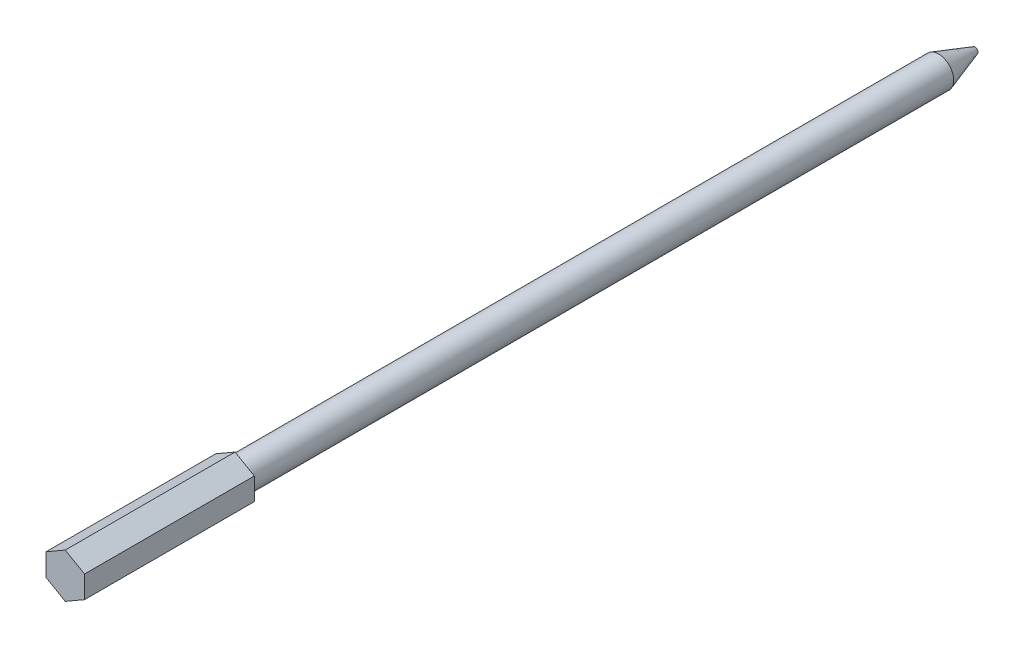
ISO-10303-21;
HEADER;
FILE_DESCRIPTION(('STEP AP214'),'2;1');
FILE_NAME('part.step','',(''),(''),'','','');
FILE_SCHEMA(('AUTOMOTIVE_DESIGN { 1 0 10303 214 1 1 1 1 }'));
ENDSEC;
DATA;
#1=APPLICATION_CONTEXT('core data for automotive mechanical design processes');
#2=APPLICATION_PROTOCOL_DEFINITION('international standard','automotive_design',2000,#1);
#3=PRODUCT_CONTEXT('',#1,'mechanical');
#4=PRODUCT('Part','Part','',(#3));
#5=PRODUCT_RELATED_PRODUCT_CATEGORY('part','',(#4));
#6=PRODUCT_DEFINITION_FORMATION('','',#4);
#7=PRODUCT_DEFINITION_CONTEXT('part definition',#1,'design');
#8=PRODUCT_DEFINITION('design','',#6,#7);
#9=PRODUCT_DEFINITION_SHAPE('','',#8);
#10=(LENGTH_UNIT() NAMED_UNIT(*) SI_UNIT(.MILLI.,.METRE.));
#11=(NAMED_UNIT(*) PLANE_ANGLE_UNIT() SI_UNIT($,.RADIAN.));
#12=(NAMED_UNIT(*) SI_UNIT($,.STERADIAN.) SOLID_ANGLE_UNIT());
#13=UNCERTAINTY_MEASURE_WITH_UNIT(LENGTH_MEASURE(1.E-05),#10,'distance_accuracy_value','');
#14=(GEOMETRIC_REPRESENTATION_CONTEXT(3) GLOBAL_UNCERTAINTY_ASSIGNED_CONTEXT((#13)) GLOBAL_UNIT_ASSIGNED_CONTEXT((#10,
#11,#12)) REPRESENTATION_CONTEXT('',''));
#15=CARTESIAN_POINT('',(0.,0.,0.));
#16=DIRECTION('',(0.,0.,1.));
#17=DIRECTION('',(1.,0.,0.));
#18=AXIS2_PLACEMENT_3D('',#15,#16,#17);
#19=CARTESIAN_POINT('',(0.,0.,122.));
#20=DIRECTION('',(0.,0.,-1.));
#21=DIRECTION('',(-1.,0.,0.));
#22=AXIS2_PLACEMENT_3D('',#19,#20,#21);
#23=CYLINDRICAL_SURFACE('',#22,2.5);
#24=CARTESIAN_POINT('',(0.,0.,6.0000000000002));
#25=DIRECTION('',(0.,0.,1.));
#26=DIRECTION('',(1.,0.,0.));
#27=AXIS2_PLACEMENT_3D('',#24,#25,#26);
#28=CIRCLE('',#27,2.5);
#29=CARTESIAN_POINT('',(2.5,0.,6.0000000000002));
#30=VERTEX_POINT('',#29);
#31=EDGE_CURVE('E25',#30,#30,#28,.T.);
#32=ORIENTED_EDGE('',*,*,#31,.T.);
#33=EDGE_LOOP('',(#32));
#34=FACE_BOUND('',#33,.T.);
#35=CARTESIAN_POINT('',(0.,0.,122.));
#36=DIRECTION('',(0.,0.,1.));
#37=DIRECTION('',(1.,0.,0.));
#38=AXIS2_PLACEMENT_3D('',#35,#36,#37);
#39=CIRCLE('',#38,2.5);
#40=CARTESIAN_POINT('',(2.5,0.,122.));
#41=VERTEX_POINT('',#40);
#42=EDGE_CURVE('E121',#41,#41,#39,.T.);
#43=ORIENTED_EDGE('',*,*,#42,.F.);
#44=EDGE_LOOP('',(#43));
#45=FACE_BOUND('',#44,.T.);
#46=ADVANCED_FACE('F16',(#34,#45),#23,.T.);
#47=CARTESIAN_POINT('',(0.,0.,0.));
#48=DIRECTION('',(0.,0.,1.));
#49=DIRECTION('',(1.,0.,0.));
#50=AXIS2_PLACEMENT_3D('',#47,#48,#49);
#51=PLANE('',#50);
#52=CARTESIAN_POINT('',(0.,0.,0.));
#53=DIRECTION('',(0.,0.,1.));
#54=DIRECTION('',(1.,0.,0.));
#55=AXIS2_PLACEMENT_3D('',#52,#53,#54);
#56=CIRCLE('',#55,0.499999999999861);
#57=CARTESIAN_POINT('',(0.499999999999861,0.,0.));
#58=VERTEX_POINT('',#57);
#59=EDGE_CURVE('E11',#58,#58,#56,.F.);
#60=ORIENTED_EDGE('',*,*,#59,.T.);
#61=EDGE_LOOP('',(#60));
#62=FACE_BOUND('',#61,.T.);
#63=ADVANCED_FACE('F140',(#62),#51,.F.);
#64=CARTESIAN_POINT('',(-3.175,-1.83308710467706,150.));
#65=DIRECTION('',(0.5,0.866025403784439,0.));
#66=DIRECTION('',(-0.866025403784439,0.5,0.));
#67=AXIS2_PLACEMENT_3D('',#64,#65,#66);
#68=PLANE('',#67);
#69=DIRECTION('',(0.866025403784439,-0.5,0.));
#70=VECTOR('',#69,1.);
#71=CARTESIAN_POINT('',(-3.175,-1.83308710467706,122.));
#72=LINE('',#71,#70);
#73=CARTESIAN_POINT('',(-3.175,-1.83308710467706,122.));
#74=VERTEX_POINT('',#73);
#75=CARTESIAN_POINT('',(0.,-3.66617420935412,122.));
#76=VERTEX_POINT('',#75);
#77=EDGE_CURVE('E102',#74,#76,#72,.T.);
#78=ORIENTED_EDGE('',*,*,#77,.T.);
#79=DIRECTION('',(0.,0.,-1.));
#80=VECTOR('',#79,1.);
#81=CARTESIAN_POINT('',(0.,-3.66617420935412,150.));
#82=LINE('',#81,#80);
#83=CARTESIAN_POINT('',(0.,-3.66617420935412,150.));
#84=VERTEX_POINT('',#83);
#85=EDGE_CURVE('E119',#84,#76,#82,.T.);
#86=ORIENTED_EDGE('',*,*,#85,.F.);
#87=DIRECTION('',(0.866025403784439,-0.5,0.));
#88=VECTOR('',#87,1.);
#89=CARTESIAN_POINT('',(-3.175,-1.83308710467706,150.));
#90=LINE('',#89,#88);
#91=CARTESIAN_POINT('',(-3.175,-1.83308710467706,150.));
#92=VERTEX_POINT('',#91);
#93=EDGE_CURVE('E112',#92,#84,#90,.T.);
#94=ORIENTED_EDGE('',*,*,#93,.F.);
#95=DIRECTION('',(0.,0.,-1.));
#96=VECTOR('',#95,1.);
#97=CARTESIAN_POINT('',(-3.175,-1.83308710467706,150.));
#98=LINE('',#97,#96);
#99=EDGE_CURVE('E98',#92,#74,#98,.T.);
#100=ORIENTED_EDGE('',*,*,#99,.T.);
#101=EDGE_LOOP('',(#78,#86,#94,#100));
#102=FACE_BOUND('',#101,.T.);
#103=ADVANCED_FACE('F145',(#102),#68,.F.);
#104=CARTESIAN_POINT('',(0.,-3.66617420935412,150.));
#105=DIRECTION('',(-0.5,0.866025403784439,0.));
#106=DIRECTION('',(-0.866025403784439,-0.5,0.));
#107=AXIS2_PLACEMENT_3D('',#104,#105,#106);
#108=PLANE('',#107);
#109=DIRECTION('',(0.866025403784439,0.5,0.));
#110=VECTOR('',#109,1.);
#111=CARTESIAN_POINT('',(0.,-3.66617420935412,122.));
#112=LINE('',#111,#110);
#113=CARTESIAN_POINT('',(3.175,-1.83308710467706,122.));
#114=VERTEX_POINT('',#113);
#115=EDGE_CURVE('E105',#76,#114,#112,.T.);
#116=ORIENTED_EDGE('',*,*,#115,.T.);
#117=DIRECTION('',(0.,0.,-1.));
#118=VECTOR('',#117,1.);
#119=CARTESIAN_POINT('',(3.175,-1.83308710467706,150.));
#120=LINE('',#119,#118);
#121=CARTESIAN_POINT('',(3.175,-1.83308710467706,150.));
#122=VERTEX_POINT('',#121);
#123=EDGE_CURVE('E116',#122,#114,#120,.T.);
#124=ORIENTED_EDGE('',*,*,#123,.F.);
#125=DIRECTION('',(0.866025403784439,0.5,0.));
#126=VECTOR('',#125,1.);
#127=CARTESIAN_POINT('',(0.,-3.66617420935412,150.));
#128=LINE('',#127,#126);
#129=EDGE_CURVE('E71',#84,#122,#128,.T.);
#130=ORIENTED_EDGE('',*,*,#129,.F.);
#131=ORIENTED_EDGE('',*,*,#85,.T.);
#132=EDGE_LOOP('',(#116,#124,#130,#131));
#133=FACE_BOUND('',#132,.T.);
#134=ADVANCED_FACE('F151',(#133),#108,.F.);
#135=CARTESIAN_POINT('',(3.175,-1.83308710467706,150.));
#136=DIRECTION('',(-1.,0.,0.));
#137=DIRECTION('',(0.,-1.,0.));
#138=AXIS2_PLACEMENT_3D('',#135,#136,#137);
#139=PLANE('',#138);
#140=DIRECTION('',(0.,1.,0.));
#141=VECTOR('',#140,1.);
#142=CARTESIAN_POINT('',(3.175,-1.83308710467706,122.));
#143=LINE('',#142,#141);
#144=CARTESIAN_POINT('',(3.175,1.83308710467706,122.));
#145=VERTEX_POINT('',#144);
#146=EDGE_CURVE('E107',#114,#145,#143,.T.);
#147=ORIENTED_EDGE('',*,*,#146,.T.);
#148=DIRECTION('',(0.,0.,-1.));
#149=VECTOR('',#148,1.);
#150=CARTESIAN_POINT('',(3.175,1.83308710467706,150.));
#151=LINE('',#150,#149);
#152=CARTESIAN_POINT('',(3.175,1.83308710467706,150.));
#153=VERTEX_POINT('',#152);
#154=EDGE_CURVE('E93',#153,#145,#151,.T.);
#155=ORIENTED_EDGE('',*,*,#154,.F.);
#156=DIRECTION('',(0.,1.,0.));
#157=VECTOR('',#156,1.);
#158=CARTESIAN_POINT('',(3.175,-1.83308710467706,150.));
#159=LINE('',#158,#157);
#160=EDGE_CURVE('E84',#122,#153,#159,.T.);
#161=ORIENTED_EDGE('',*,*,#160,.F.);
#162=ORIENTED_EDGE('',*,*,#123,.T.);
#163=EDGE_LOOP('',(#147,#155,#161,#162));
#164=FACE_BOUND('',#163,.T.);
#165=ADVANCED_FACE('F155',(#164),#139,.F.);
#166=CARTESIAN_POINT('',(3.175,1.83308710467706,150.));
#167=DIRECTION('',(-0.5,-0.866025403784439,0.));
#168=DIRECTION('',(0.866025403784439,-0.5,0.));
#169=AXIS2_PLACEMENT_3D('',#166,#167,#168);
#170=PLANE('',#169);
#171=DIRECTION('',(-0.866025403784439,0.5,0.));
#172=VECTOR('',#171,1.);
#173=CARTESIAN_POINT('',(3.175,1.83308710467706,122.));
#174=LINE('',#173,#172);
#175=CARTESIAN_POINT('',(0.,3.66617420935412,122.));
#176=VERTEX_POINT('',#175);
#177=EDGE_CURVE('E92',#145,#176,#174,.T.);
#178=ORIENTED_EDGE('',*,*,#177,.T.);
#179=DIRECTION('',(0.,0.,-1.));
#180=VECTOR('',#179,1.);
#181=CARTESIAN_POINT('',(0.,3.66617420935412,150.));
#182=LINE('',#181,#180);
#183=CARTESIAN_POINT('',(0.,3.66617420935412,150.));
#184=VERTEX_POINT('',#183);
#185=EDGE_CURVE('E89',#184,#176,#182,.T.);
#186=ORIENTED_EDGE('',*,*,#185,.F.);
#187=DIRECTION('',(-0.866025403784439,0.5,0.));
#188=VECTOR('',#187,1.);
#189=CARTESIAN_POINT('',(3.175,1.83308710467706,150.));
#190=LINE('',#189,#188);
#191=EDGE_CURVE('E78',#153,#184,#190,.T.);
#192=ORIENTED_EDGE('',*,*,#191,.F.);
#193=ORIENTED_EDGE('',*,*,#154,.T.);
#194=EDGE_LOOP('',(#178,#186,#192,#193));
#195=FACE_BOUND('',#194,.T.);
#196=ADVANCED_FACE('F90',(#195),#170,.F.);
#197=CARTESIAN_POINT('',(0.,3.66617420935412,150.));
#198=DIRECTION('',(0.5,-0.866025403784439,0.));
#199=DIRECTION('',(0.866025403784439,0.5,0.));
#200=AXIS2_PLACEMENT_3D('',#197,#198,#199);
#201=PLANE('',#200);
#202=DIRECTION('',(-0.866025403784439,-0.5,0.));
#203=VECTOR('',#202,1.);
#204=CARTESIAN_POINT('',(0.,3.66617420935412,122.));
#205=LINE('',#204,#203);
#206=CARTESIAN_POINT('',(-3.175,1.83308710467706,122.));
#207=VERTEX_POINT('',#206);
#208=EDGE_CURVE('E56',#176,#207,#205,.T.);
#209=ORIENTED_EDGE('',*,*,#208,.T.);
#210=DIRECTION('',(0.,0.,-1.));
#211=VECTOR('',#210,1.);
#212=CARTESIAN_POINT('',(-3.175,1.83308710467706,150.));
#213=LINE('',#212,#211);
#214=CARTESIAN_POINT('',(-3.175,1.83308710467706,150.));
#215=VERTEX_POINT('',#214);
#216=EDGE_CURVE('E94',#215,#207,#213,.T.);
#217=ORIENTED_EDGE('',*,*,#216,.F.);
#218=DIRECTION('',(-0.866025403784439,-0.5,0.));
#219=VECTOR('',#218,1.);
#220=CARTESIAN_POINT('',(0.,3.66617420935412,150.));
#221=LINE('',#220,#219);
#222=EDGE_CURVE('E82',#184,#215,#221,.T.);
#223=ORIENTED_EDGE('',*,*,#222,.F.);
#224=ORIENTED_EDGE('',*,*,#185,.T.);
#225=EDGE_LOOP('',(#209,#217,#223,#224));
#226=FACE_BOUND('',#225,.T.);
#227=ADVANCED_FACE('F96',(#226),#201,.F.);
#228=CARTESIAN_POINT('',(-3.175,1.83308710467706,150.));
#229=DIRECTION('',(1.,0.,0.));
#230=DIRECTION('',(0.,0.,-1.));
#231=AXIS2_PLACEMENT_3D('',#228,#229,#230);
#232=PLANE('',#231);
#233=DIRECTION('',(0.,-1.,0.));
#234=VECTOR('',#233,1.);
#235=CARTESIAN_POINT('',(-3.175,1.83308710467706,122.));
#236=LINE('',#235,#234);
#237=EDGE_CURVE('E62',#207,#74,#236,.T.);
#238=ORIENTED_EDGE('',*,*,#237,.T.);
#239=ORIENTED_EDGE('',*,*,#99,.F.);
#240=DIRECTION('',(0.,-1.,0.));
#241=VECTOR('',#240,1.);
#242=CARTESIAN_POINT('',(-3.175,1.83308710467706,150.));
#243=LINE('',#242,#241);
#244=EDGE_CURVE('E33',#215,#92,#243,.T.);
#245=ORIENTED_EDGE('',*,*,#244,.F.);
#246=ORIENTED_EDGE('',*,*,#216,.T.);
#247=EDGE_LOOP('',(#238,#239,#245,#246));
#248=FACE_BOUND('',#247,.T.);
#249=ADVANCED_FACE('F163',(#248),#232,.F.);
#250=CARTESIAN_POINT('',(0.,0.,150.));
#251=DIRECTION('',(0.,0.,1.));
#252=DIRECTION('',(1.,0.,0.));
#253=AXIS2_PLACEMENT_3D('',#250,#251,#252);
#254=PLANE('',#253);
#255=ORIENTED_EDGE('',*,*,#93,.T.);
#256=ORIENTED_EDGE('',*,*,#129,.T.);
#257=ORIENTED_EDGE('',*,*,#160,.T.);
#258=ORIENTED_EDGE('',*,*,#191,.T.);
#259=ORIENTED_EDGE('',*,*,#222,.T.);
#260=ORIENTED_EDGE('',*,*,#244,.T.);
#261=EDGE_LOOP('',(#255,#256,#257,#258,#259,#260));
#262=FACE_BOUND('',#261,.T.);
#263=ADVANCED_FACE('F80',(#262),#254,.T.);
#264=CARTESIAN_POINT('',(0.,0.,122.));
#265=DIRECTION('',(0.,0.,1.));
#266=DIRECTION('',(1.,0.,0.));
#267=AXIS2_PLACEMENT_3D('',#264,#265,#266);
#268=PLANE('',#267);
#269=ORIENTED_EDGE('',*,*,#42,.T.);
#270=EDGE_LOOP('',(#269));
#271=FACE_BOUND('',#270,.T.);
#272=ORIENTED_EDGE('',*,*,#77,.F.);
#273=ORIENTED_EDGE('',*,*,#237,.F.);
#274=ORIENTED_EDGE('',*,*,#208,.F.);
#275=ORIENTED_EDGE('',*,*,#177,.F.);
#276=ORIENTED_EDGE('',*,*,#146,.F.);
#277=ORIENTED_EDGE('',*,*,#115,.F.);
#278=EDGE_LOOP('',(#272,#273,#274,#275,#276,#277));
#279=FACE_BOUND('',#278,.T.);
#280=ADVANCED_FACE('F129',(#271,#279),#268,.F.);
#281=CARTESIAN_POINT('',(0.,0.,6.0000000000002));
#282=DIRECTION('',(0.,0.,1.));
#283=DIRECTION('',(1.,0.,0.));
#284=AXIS2_PLACEMENT_3D('',#281,#282,#283);
#285=CONICAL_SURFACE('',#284,2.5,0.321750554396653);
#286=CARTESIAN_POINT('',(0.499999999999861,0.,0.));
#287=CARTESIAN_POINT('',(0.520833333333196,0.,0.0625000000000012));
#288=CARTESIAN_POINT('',(0.541666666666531,0.,0.125000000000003));
#289=CARTESIAN_POINT('',(0.5833333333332,0.,0.250000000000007));
#290=CARTESIAN_POINT('',(0.604166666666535,0.,0.312500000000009));
#291=CARTESIAN_POINT('',(0.645833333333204,0.,0.437500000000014));
#292=CARTESIAN_POINT('',(0.666666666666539,0.,0.500000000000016));
#293=CARTESIAN_POINT('',(0.708333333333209,0.,0.62500000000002));
#294=CARTESIAN_POINT('',(0.729166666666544,0.,0.687500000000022));
#295=CARTESIAN_POINT('',(0.770833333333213,0.,0.812500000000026));
#296=CARTESIAN_POINT('',(0.791666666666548,0.,0.875000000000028));
#297=CARTESIAN_POINT('',(0.833333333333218,0.,1.00000000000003));
#298=CARTESIAN_POINT('',(0.854166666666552,0.,1.06250000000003));
#299=CARTESIAN_POINT('',(0.895833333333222,0.,1.18750000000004));
#300=CARTESIAN_POINT('',(0.916666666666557,0.,1.25000000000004));
#301=CARTESIAN_POINT('',(0.958333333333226,0.,1.37500000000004));
#302=CARTESIAN_POINT('',(0.979166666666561,0.,1.43750000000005));
#303=CARTESIAN_POINT('',(1.02083333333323,0.,1.56250000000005));
#304=CARTESIAN_POINT('',(1.04166666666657,0.,1.62500000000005));
#305=CARTESIAN_POINT('',(1.08333333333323,0.,1.75000000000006));
#306=CARTESIAN_POINT('',(1.10416666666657,0.,1.81250000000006));
#307=CARTESIAN_POINT('',(1.14583333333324,0.,1.93750000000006));
#308=CARTESIAN_POINT('',(1.16666666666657,0.,2.00000000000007));
#309=CARTESIAN_POINT('',(1.20833333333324,0.,2.12500000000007));
#310=CARTESIAN_POINT('',(1.22916666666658,0.,2.18750000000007));
#311=CARTESIAN_POINT('',(1.27083333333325,0.,2.31250000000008));
#312=CARTESIAN_POINT('',(1.29166666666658,0.,2.37500000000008));
#313=CARTESIAN_POINT('',(1.33333333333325,0.,2.50000000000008));
#314=CARTESIAN_POINT('',(1.35416666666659,0.,2.56250000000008));
#315=CARTESIAN_POINT('',(1.39583333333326,0.,2.68750000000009));
#316=CARTESIAN_POINT('',(1.41666666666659,0.,2.75000000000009));
#317=CARTESIAN_POINT('',(1.45833333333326,0.,2.8750000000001));
#318=CARTESIAN_POINT('',(1.4791666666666,0.,2.9375000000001));
#319=CARTESIAN_POINT('',(1.52083333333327,0.,3.0625000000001));
#320=CARTESIAN_POINT('',(1.5416666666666,0.,3.1250000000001));
#321=CARTESIAN_POINT('',(1.58333333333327,0.,3.25000000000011));
#322=CARTESIAN_POINT('',(1.6041666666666,0.,3.31250000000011));
#323=CARTESIAN_POINT('',(1.64583333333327,0.,3.43750000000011));
#324=CARTESIAN_POINT('',(1.66666666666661,0.,3.50000000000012));
#325=CARTESIAN_POINT('',(1.70833333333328,0.,3.62500000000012));
#326=CARTESIAN_POINT('',(1.72916666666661,0.,3.68750000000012));
#327=CARTESIAN_POINT('',(1.77083333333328,0.,3.81250000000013));
#328=CARTESIAN_POINT('',(1.79166666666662,0.,3.87500000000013));
#329=CARTESIAN_POINT('',(1.83333333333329,0.,4.00000000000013));
#330=CARTESIAN_POINT('',(1.85416666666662,0.,4.06250000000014));
#331=CARTESIAN_POINT('',(1.89583333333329,0.,4.18750000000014));
#332=CARTESIAN_POINT('',(1.91666666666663,0.,4.25000000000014));
#333=CARTESIAN_POINT('',(1.9583333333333,0.,4.37500000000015));
#334=CARTESIAN_POINT('',(1.97916666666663,0.,4.43750000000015));
#335=CARTESIAN_POINT('',(2.0208333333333,0.,4.56250000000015));
#336=CARTESIAN_POINT('',(2.04166666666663,0.,4.62500000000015));
#337=CARTESIAN_POINT('',(2.0833333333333,0.,4.75000000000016));
#338=CARTESIAN_POINT('',(2.10416666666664,0.,4.81250000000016));
#339=CARTESIAN_POINT('',(2.14583333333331,0.,4.93750000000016));
#340=CARTESIAN_POINT('',(2.16666666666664,0.,5.00000000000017));
#341=CARTESIAN_POINT('',(2.20833333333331,0.,5.12500000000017));
#342=CARTESIAN_POINT('',(2.22916666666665,0.,5.18750000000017));
#343=CARTESIAN_POINT('',(2.27083333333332,0.,5.31250000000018));
#344=CARTESIAN_POINT('',(2.29166666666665,0.,5.37500000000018));
#345=CARTESIAN_POINT('',(2.33333333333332,0.,5.50000000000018));
#346=CARTESIAN_POINT('',(2.35416666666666,0.,5.56250000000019));
#347=CARTESIAN_POINT('',(2.39583333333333,0.,5.68750000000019));
#348=CARTESIAN_POINT('',(2.41666666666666,0.,5.75000000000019));
#349=CARTESIAN_POINT('',(2.45833333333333,0.,5.8750000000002));
#350=CARTESIAN_POINT('',(2.47916666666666,0.,5.9375000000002));
#351=CARTESIAN_POINT('',(2.5,0.,6.0000000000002));
#352=B_SPLINE_CURVE_WITH_KNOTS('',3,(#286,#287,#288,#289,#290,#291,#292,#293,#294,#295,#296,
#297,#298,#299,#300,#301,#302,#303,#304,#305,#306,#307,#308,#309,#310,#311,#312,#313,#314,#315,
#316,#317,#318,#319,#320,#321,#322,#323,#324,#325,#326,#327,#328,#329,#330,#331,#332,#333,#334,
#335,#336,#337,#338,#339,#340,#341,#342,#343,#344,#345,#346,#347,#348,#349,#350,#351),
.UNSPECIFIED.,.F.,.F.,(4,2,2,2,2,2,2,2,2,2,2,2,2,2,2,2,2,2,2,2,2,2,2,2,2,2,2,2,2,2,2,2,4),(0.,
0.197642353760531,0.395284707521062,0.592927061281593,0.790569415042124,0.988211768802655,
1.18585412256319,1.38349647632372,1.58113883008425,1.77878118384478,1.97642353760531,
2.17406589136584,2.37170824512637,2.5693505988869,2.76699295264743,2.96463530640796,
3.16227766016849,3.35992001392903,3.55756236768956,3.75520472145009,3.95284707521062,
4.15048942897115,4.34813178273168,4.54577413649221,4.74341649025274,4.94105884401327,
5.1387011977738,5.33634355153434,5.53398590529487,5.7316282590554,5.92927061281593,
6.12691296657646,6.32455532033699),.UNSPECIFIED.);
#353=EDGE_CURVE('BSEAM18',#58,#30,#352,.T.);
#354=ORIENTED_EDGE('',*,*,#59,.F.);
#355=ORIENTED_EDGE('',*,*,#31,.F.);
#356=ORIENTED_EDGE('',*,*,#353,.T.);
#357=ORIENTED_EDGE('',*,*,#353,.F.);
#358=EDGE_LOOP('',(#354,#356,#355,#357));
#359=FACE_BOUND('',#358,.T.);
#360=ADVANCED_FACE('F18',(#359),#285,.T.);
#361=CLOSED_SHELL('',(#46,#63,#103,#134,#165,#196,#227,#249,#263,#280,#360));
#362=MANIFOLD_SOLID_BREP('B1',#361);
#363=ADVANCED_BREP_SHAPE_REPRESENTATION('',(#18,#362),#14);
#364=SHAPE_DEFINITION_REPRESENTATION(#9,#363);
ENDSEC;
END-ISO-10303-21;
